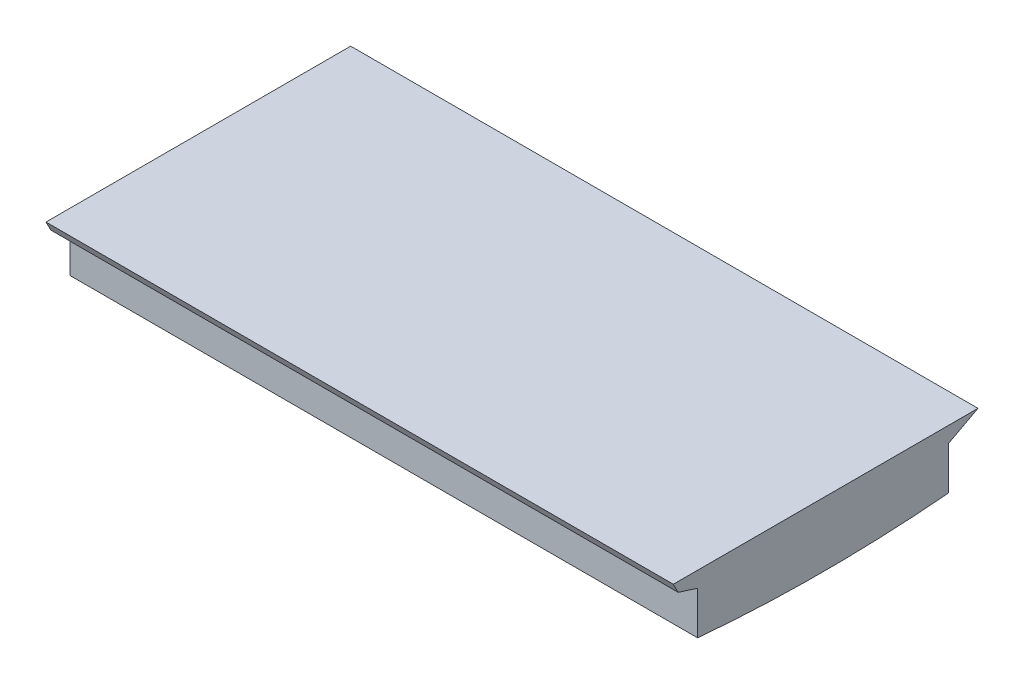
ISO-10303-21;
HEADER;
FILE_DESCRIPTION(('STEP AP214'),'2;1');
FILE_NAME('part.step','',(''),(''),'','','');
FILE_SCHEMA(('AUTOMOTIVE_DESIGN { 1 0 10303 214 1 1 1 1 }'));
ENDSEC;
DATA;
#1=APPLICATION_CONTEXT('core data for automotive mechanical design processes');
#2=APPLICATION_PROTOCOL_DEFINITION('international standard','automotive_design',2000,#1);
#3=PRODUCT_CONTEXT('',#1,'mechanical');
#4=PRODUCT('Part','Part','',(#3));
#5=PRODUCT_RELATED_PRODUCT_CATEGORY('part','',(#4));
#6=PRODUCT_DEFINITION_FORMATION('','',#4);
#7=PRODUCT_DEFINITION_CONTEXT('part definition',#1,'design');
#8=PRODUCT_DEFINITION('design','',#6,#7);
#9=PRODUCT_DEFINITION_SHAPE('','',#8);
#10=(LENGTH_UNIT() NAMED_UNIT(*) SI_UNIT(.MILLI.,.METRE.));
#11=(NAMED_UNIT(*) PLANE_ANGLE_UNIT() SI_UNIT($,.RADIAN.));
#12=(NAMED_UNIT(*) SI_UNIT($,.STERADIAN.) SOLID_ANGLE_UNIT());
#13=UNCERTAINTY_MEASURE_WITH_UNIT(LENGTH_MEASURE(1.E-05),#10,'distance_accuracy_value','');
#14=(GEOMETRIC_REPRESENTATION_CONTEXT(3) GLOBAL_UNCERTAINTY_ASSIGNED_CONTEXT((#13)) GLOBAL_UNIT_ASSIGNED_CONTEXT((#10,
#11,#12)) REPRESENTATION_CONTEXT('',''));
#15=CARTESIAN_POINT('',(0.,0.,0.));
#16=DIRECTION('',(0.,0.,1.));
#17=DIRECTION('',(1.,0.,0.));
#18=AXIS2_PLACEMENT_3D('',#15,#16,#17);
#19=CARTESIAN_POINT('',(15.,1.025,6.));
#20=DIRECTION('',(0.,0.,-1.));
#21=DIRECTION('',(-1.,0.,0.));
#22=AXIS2_PLACEMENT_3D('',#19,#20,#21);
#23=PLANE('',#22);
#24=DIRECTION('',(0.,-1.,0.));
#25=VECTOR('',#24,1.);
#26=CARTESIAN_POINT('',(-15.,1.025,6.));
#27=LINE('',#26,#25);
#28=CARTESIAN_POINT('',(-15.,1.025,6.));
#29=VERTEX_POINT('',#28);
#30=CARTESIAN_POINT('',(-15.,-1.025,6.));
#31=VERTEX_POINT('',#30);
#32=EDGE_CURVE('E97',#29,#31,#27,.T.);
#33=ORIENTED_EDGE('',*,*,#32,.T.);
#34=DIRECTION('',(-1.,0.,0.));
#35=VECTOR('',#34,1.);
#36=CARTESIAN_POINT('',(15.,-1.025,6.));
#37=LINE('',#36,#35);
#38=CARTESIAN_POINT('',(15.,-1.025,6.));
#39=VERTEX_POINT('',#38);
#40=EDGE_CURVE('E11',#39,#31,#37,.T.);
#41=ORIENTED_EDGE('',*,*,#40,.F.);
#42=DIRECTION('',(0.,-1.,0.));
#43=VECTOR('',#42,1.);
#44=CARTESIAN_POINT('',(15.,1.025,6.));
#45=LINE('',#44,#43);
#46=CARTESIAN_POINT('',(15.,1.025,6.));
#47=VERTEX_POINT('',#46);
#48=EDGE_CURVE('E96',#47,#39,#45,.T.);
#49=ORIENTED_EDGE('',*,*,#48,.F.);
#50=DIRECTION('',(-1.,0.,0.));
#51=VECTOR('',#50,1.);
#52=CARTESIAN_POINT('',(15.,1.025,6.));
#53=LINE('',#52,#51);
#54=EDGE_CURVE('E138',#47,#29,#53,.T.);
#55=ORIENTED_EDGE('',*,*,#54,.T.);
#56=EDGE_LOOP('',(#33,#41,#49,#55));
#57=FACE_BOUND('',#56,.T.);
#58=ADVANCED_FACE('F26',(#57),#23,.F.);
#59=CARTESIAN_POINT('',(15.,1.025,-6.));
#60=DIRECTION('',(0.,0.,1.));
#61=DIRECTION('',(0.,-1.,0.));
#62=AXIS2_PLACEMENT_3D('',#59,#60,#61);
#63=PLANE('',#62);
#64=DIRECTION('',(0.,1.,0.));
#65=VECTOR('',#64,1.);
#66=CARTESIAN_POINT('',(-15.,1.025,-6.));
#67=LINE('',#66,#65);
#68=CARTESIAN_POINT('',(-15.,-1.025,-6.));
#69=VERTEX_POINT('',#68);
#70=CARTESIAN_POINT('',(-15.,1.025,-6.));
#71=VERTEX_POINT('',#70);
#72=EDGE_CURVE('E84',#69,#71,#67,.T.);
#73=ORIENTED_EDGE('',*,*,#72,.T.);
#74=DIRECTION('',(-1.,0.,0.));
#75=VECTOR('',#74,1.);
#76=CARTESIAN_POINT('',(15.,1.025,-6.));
#77=LINE('',#76,#75);
#78=CARTESIAN_POINT('',(15.,1.025,-6.));
#79=VERTEX_POINT('',#78);
#80=EDGE_CURVE('E105',#79,#71,#77,.T.);
#81=ORIENTED_EDGE('',*,*,#80,.F.);
#82=DIRECTION('',(0.,1.,0.));
#83=VECTOR('',#82,1.);
#84=CARTESIAN_POINT('',(15.,1.025,-6.));
#85=LINE('',#84,#83);
#86=CARTESIAN_POINT('',(15.,-1.025,-6.));
#87=VERTEX_POINT('',#86);
#88=EDGE_CURVE('E101',#87,#79,#85,.T.);
#89=ORIENTED_EDGE('',*,*,#88,.F.);
#90=DIRECTION('',(-1.,0.,0.));
#91=VECTOR('',#90,1.);
#92=CARTESIAN_POINT('',(15.,-1.025,-6.));
#93=LINE('',#92,#91);
#94=EDGE_CURVE('E33',#87,#69,#93,.T.);
#95=ORIENTED_EDGE('',*,*,#94,.T.);
#96=EDGE_LOOP('',(#73,#81,#89,#95));
#97=FACE_BOUND('',#96,.T.);
#98=ADVANCED_FACE('F100',(#97),#63,.F.);
#99=CARTESIAN_POINT('',(15.,-1.025,6.));
#100=DIRECTION('',(1.,0.,0.));
#101=DIRECTION('',(0.,0.,-1.));
#102=AXIS2_PLACEMENT_3D('',#99,#100,#101);
#103=PLANE('',#102);
#104=DIRECTION('',(0.,0.89042178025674,0.455136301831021));
#105=VECTOR('',#104,1.);
#106=CARTESIAN_POINT('',(15.,1.32692535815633,6.92923070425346));
#107=LINE('',#106,#105);
#108=CARTESIAN_POINT('',(15.,1.32692535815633,6.92923070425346));
#109=VERTEX_POINT('',#108);
#110=CARTESIAN_POINT('',(15.,1.775,7.15826265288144));
#111=VERTEX_POINT('',#110);
#112=EDGE_CURVE('E40',#109,#111,#107,.T.);
#113=ORIENTED_EDGE('',*,*,#112,.F.);
#114=DIRECTION('',(0.,-0.309016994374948,-0.951056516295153));
#115=VECTOR('',#114,1.);
#116=CARTESIAN_POINT('',(15.,1.775,8.30826265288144));
#117=LINE('',#116,#115);
#118=EDGE_CURVE('E47',#109,#47,#117,.T.);
#119=ORIENTED_EDGE('',*,*,#118,.T.);
#120=ORIENTED_EDGE('',*,*,#48,.T.);
#121=CARTESIAN_POINT('',(15.,66.2078044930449,0.));
#122=DIRECTION('',(1.,0.,0.));
#123=DIRECTION('',(0.,0.,-1.));
#124=AXIS2_PLACEMENT_3D('',#121,#122,#123);
#125=CIRCLE('',#124,67.5);
#126=EDGE_CURVE('E108',#39,#87,#125,.T.);
#127=ORIENTED_EDGE('',*,*,#126,.T.);
#128=ORIENTED_EDGE('',*,*,#88,.T.);
#129=DIRECTION('',(0.,0.469471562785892,-0.882947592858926));
#130=VECTOR('',#129,1.);
#131=CARTESIAN_POINT('',(15.,1.025,-6.));
#132=LINE('',#131,#130);
#133=CARTESIAN_POINT('',(15.,1.775,-7.41054484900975));
#134=VERTEX_POINT('',#133);
#135=EDGE_CURVE('E127',#79,#134,#132,.T.);
#136=ORIENTED_EDGE('',*,*,#135,.T.);
#137=DIRECTION('',(0.,0.,1.));
#138=VECTOR('',#137,1.);
#139=CARTESIAN_POINT('',(15.,1.775,8.30826265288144));
#140=LINE('',#139,#138);
#141=EDGE_CURVE('E129',#134,#111,#140,.T.);
#142=ORIENTED_EDGE('',*,*,#141,.T.);
#143=EDGE_LOOP('',(#113,#119,#120,#127,#128,#136,#142));
#144=FACE_BOUND('',#143,.T.);
#145=ADVANCED_FACE('F146',(#144),#103,.T.);
#146=CARTESIAN_POINT('',(-15.,-1.025,6.));
#147=DIRECTION('',(1.,0.,0.));
#148=DIRECTION('',(0.,0.,-1.));
#149=AXIS2_PLACEMENT_3D('',#146,#147,#148);
#150=PLANE('',#149);
#151=DIRECTION('',(0.,-0.309016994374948,-0.951056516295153));
#152=VECTOR('',#151,1.);
#153=CARTESIAN_POINT('',(-15.,1.775,8.30826265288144));
#154=LINE('',#153,#152);
#155=CARTESIAN_POINT('',(-15.,1.32692535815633,6.92923070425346));
#156=VERTEX_POINT('',#155);
#157=EDGE_CURVE('E119',#156,#29,#154,.T.);
#158=ORIENTED_EDGE('',*,*,#157,.F.);
#159=DIRECTION('',(0.,0.89042178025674,0.455136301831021));
#160=VECTOR('',#159,1.);
#161=CARTESIAN_POINT('',(-15.,1.32692535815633,6.92923070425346));
#162=LINE('',#161,#160);
#163=CARTESIAN_POINT('',(-15.,1.775,7.15826265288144));
#164=VERTEX_POINT('',#163);
#165=EDGE_CURVE('E110',#156,#164,#162,.T.);
#166=ORIENTED_EDGE('',*,*,#165,.T.);
#167=DIRECTION('',(0.,0.,1.));
#168=VECTOR('',#167,1.);
#169=CARTESIAN_POINT('',(-15.,1.775,8.30826265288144));
#170=LINE('',#169,#168);
#171=CARTESIAN_POINT('',(-15.,1.775,-7.41054484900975));
#172=VERTEX_POINT('',#171);
#173=EDGE_CURVE('E123',#172,#164,#170,.T.);
#174=ORIENTED_EDGE('',*,*,#173,.F.);
#175=DIRECTION('',(0.,0.469471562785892,-0.882947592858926));
#176=VECTOR('',#175,1.);
#177=CARTESIAN_POINT('',(-15.,1.025,-6.));
#178=LINE('',#177,#176);
#179=EDGE_CURVE('E92',#71,#172,#178,.T.);
#180=ORIENTED_EDGE('',*,*,#179,.F.);
#181=ORIENTED_EDGE('',*,*,#72,.F.);
#182=CARTESIAN_POINT('',(-15.,66.2078044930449,0.));
#183=DIRECTION('',(1.,0.,0.));
#184=DIRECTION('',(0.,0.,-1.));
#185=AXIS2_PLACEMENT_3D('',#182,#183,#184);
#186=CIRCLE('',#185,67.5);
#187=EDGE_CURVE('E90',#31,#69,#186,.T.);
#188=ORIENTED_EDGE('',*,*,#187,.F.);
#189=ORIENTED_EDGE('',*,*,#32,.F.);
#190=EDGE_LOOP('',(#158,#166,#174,#180,#181,#188,#189));
#191=FACE_BOUND('',#190,.T.);
#192=ADVANCED_FACE('F87',(#191),#150,.F.);
#193=CARTESIAN_POINT('',(15.,1.775,8.30826265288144));
#194=DIRECTION('',(0.,0.951056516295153,-0.309016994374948));
#195=DIRECTION('',(0.,0.309016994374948,0.951056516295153));
#196=AXIS2_PLACEMENT_3D('',#193,#194,#195);
#197=PLANE('',#196);
#198=ORIENTED_EDGE('',*,*,#118,.F.);
#199=DIRECTION('',(1.,0.,0.));
#200=VECTOR('',#199,1.);
#201=CARTESIAN_POINT('',(-15.,1.32692535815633,6.92923070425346));
#202=LINE('',#201,#200);
#203=EDGE_CURVE('E116',#156,#109,#202,.T.);
#204=ORIENTED_EDGE('',*,*,#203,.F.);
#205=ORIENTED_EDGE('',*,*,#157,.T.);
#206=ORIENTED_EDGE('',*,*,#54,.F.);
#207=EDGE_LOOP('',(#198,#204,#205,#206));
#208=FACE_BOUND('',#207,.T.);
#209=ADVANCED_FACE('F151',(#208),#197,.F.);
#210=CARTESIAN_POINT('',(15.,1.025,-6.));
#211=DIRECTION('',(0.,0.882947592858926,0.469471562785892));
#212=DIRECTION('',(0.,-0.469471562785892,0.882947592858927));
#213=AXIS2_PLACEMENT_3D('',#210,#211,#212);
#214=PLANE('',#213);
#215=ORIENTED_EDGE('',*,*,#179,.T.);
#216=DIRECTION('',(-1.,0.,0.));
#217=VECTOR('',#216,1.);
#218=CARTESIAN_POINT('',(15.,1.775,-7.41054484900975));
#219=LINE('',#218,#217);
#220=EDGE_CURVE('E132',#134,#172,#219,.T.);
#221=ORIENTED_EDGE('',*,*,#220,.F.);
#222=ORIENTED_EDGE('',*,*,#135,.F.);
#223=ORIENTED_EDGE('',*,*,#80,.T.);
#224=EDGE_LOOP('',(#215,#221,#222,#223));
#225=FACE_BOUND('',#224,.T.);
#226=ADVANCED_FACE('F143',(#225),#214,.F.);
#227=CARTESIAN_POINT('',(15.,1.775,8.30826265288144));
#228=DIRECTION('',(0.,-1.,0.));
#229=DIRECTION('',(0.,0.,-1.));
#230=AXIS2_PLACEMENT_3D('',#227,#228,#229);
#231=PLANE('',#230);
#232=ORIENTED_EDGE('',*,*,#173,.T.);
#233=DIRECTION('',(1.,0.,0.));
#234=VECTOR('',#233,1.);
#235=CARTESIAN_POINT('',(-15.,1.775,7.15826265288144));
#236=LINE('',#235,#234);
#237=EDGE_CURVE('E117',#164,#111,#236,.T.);
#238=ORIENTED_EDGE('',*,*,#237,.T.);
#239=ORIENTED_EDGE('',*,*,#141,.F.);
#240=ORIENTED_EDGE('',*,*,#220,.T.);
#241=EDGE_LOOP('',(#232,#238,#239,#240));
#242=FACE_BOUND('',#241,.T.);
#243=ADVANCED_FACE('F154',(#242),#231,.F.);
#244=CARTESIAN_POINT('',(-15.,1.32692535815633,6.92923070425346));
#245=DIRECTION('',(0.,0.455136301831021,-0.89042178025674));
#246=DIRECTION('',(0.,0.89042178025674,0.455136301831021));
#247=AXIS2_PLACEMENT_3D('',#244,#245,#246);
#248=PLANE('',#247);
#249=ORIENTED_EDGE('',*,*,#112,.T.);
#250=ORIENTED_EDGE('',*,*,#237,.F.);
#251=ORIENTED_EDGE('',*,*,#165,.F.);
#252=ORIENTED_EDGE('',*,*,#203,.T.);
#253=EDGE_LOOP('',(#249,#250,#251,#252));
#254=FACE_BOUND('',#253,.T.);
#255=ADVANCED_FACE('F152',(#254),#248,.F.);
#256=CARTESIAN_POINT('',(-15.,66.2078044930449,0.));
#257=DIRECTION('',(1.,0.,0.));
#258=DIRECTION('',(0.,0.,-1.));
#259=AXIS2_PLACEMENT_3D('',#256,#257,#258);
#260=CYLINDRICAL_SURFACE('',#259,67.5);
#261=ORIENTED_EDGE('',*,*,#126,.F.);
#262=ORIENTED_EDGE('',*,*,#40,.T.);
#263=ORIENTED_EDGE('',*,*,#187,.T.);
#264=ORIENTED_EDGE('',*,*,#94,.F.);
#265=EDGE_LOOP('',(#261,#262,#263,#264));
#266=FACE_BOUND('',#265,.T.);
#267=ADVANCED_FACE('F106',(#266),#260,.T.);
#268=CLOSED_SHELL('',(#58,#98,#145,#192,#209,#226,#243,#255,#267));
#269=MANIFOLD_SOLID_BREP('B2',#268);
#270=ADVANCED_BREP_SHAPE_REPRESENTATION('',(#18,#269),#14);
#271=SHAPE_DEFINITION_REPRESENTATION(#9,#270);
ENDSEC;
END-ISO-10303-21;
